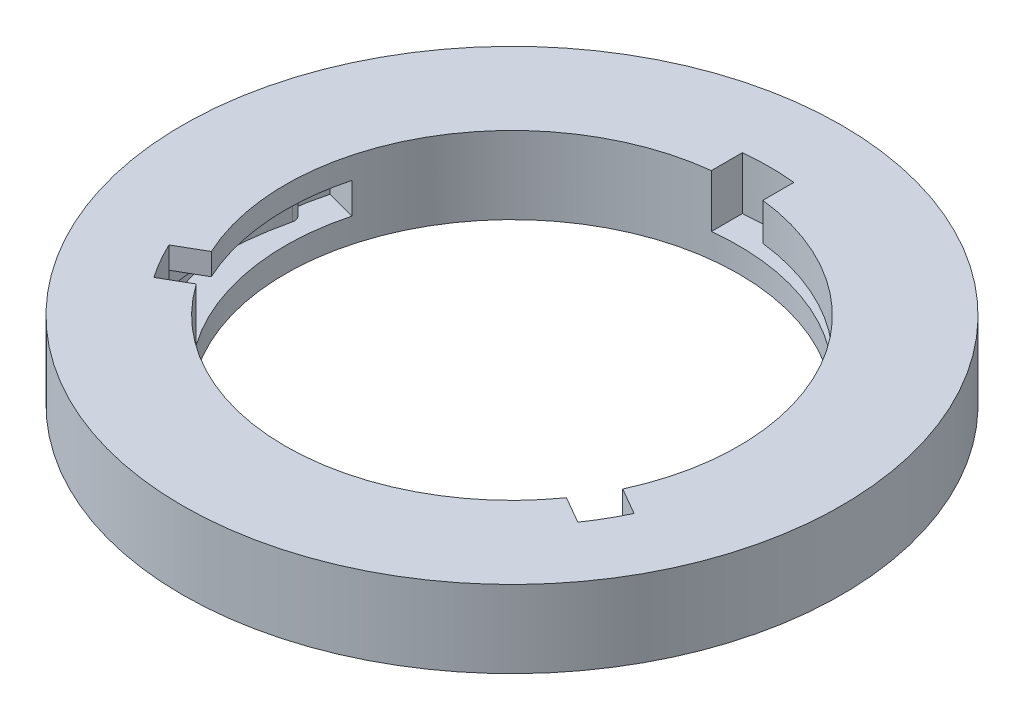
ISO-10303-21;
HEADER;
FILE_DESCRIPTION(('STEP AP214'),'2;1');
FILE_NAME('part.step','',(''),(''),'','','');
FILE_SCHEMA(('AUTOMOTIVE_DESIGN { 1 0 10303 214 1 1 1 1 }'));
ENDSEC;
DATA;
#1=APPLICATION_CONTEXT('core data for automotive mechanical design processes');
#2=APPLICATION_PROTOCOL_DEFINITION('international standard','automotive_design',2000,#1);
#3=PRODUCT_CONTEXT('',#1,'mechanical');
#4=PRODUCT('Part','Part','',(#3));
#5=PRODUCT_RELATED_PRODUCT_CATEGORY('part','',(#4));
#6=PRODUCT_DEFINITION_FORMATION('','',#4);
#7=PRODUCT_DEFINITION_CONTEXT('part definition',#1,'design');
#8=PRODUCT_DEFINITION('design','',#6,#7);
#9=PRODUCT_DEFINITION_SHAPE('','',#8);
#10=(LENGTH_UNIT() NAMED_UNIT(*) SI_UNIT(.MILLI.,.METRE.));
#11=(NAMED_UNIT(*) PLANE_ANGLE_UNIT() SI_UNIT($,.RADIAN.));
#12=(NAMED_UNIT(*) SI_UNIT($,.STERADIAN.) SOLID_ANGLE_UNIT());
#13=UNCERTAINTY_MEASURE_WITH_UNIT(LENGTH_MEASURE(1.E-05),#10,'distance_accuracy_value','');
#14=(GEOMETRIC_REPRESENTATION_CONTEXT(3) GLOBAL_UNCERTAINTY_ASSIGNED_CONTEXT((#13)) GLOBAL_UNIT_ASSIGNED_CONTEXT((#10,
#11,#12)) REPRESENTATION_CONTEXT('',''));
#15=CARTESIAN_POINT('',(0.,0.,0.));
#16=DIRECTION('',(0.,0.,1.));
#17=DIRECTION('',(1.,0.,0.));
#18=AXIS2_PLACEMENT_3D('',#15,#16,#17);
#19=CARTESIAN_POINT('',(0.,40.3076120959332,0.));
#20=DIRECTION('',(0.,1.,0.));
#21=DIRECTION('',(0.,0.,1.));
#22=AXIS2_PLACEMENT_3D('',#19,#20,#21);
#23=CYLINDRICAL_SURFACE('',#22,44.);
#24=CARTESIAN_POINT('',(0.,0.,0.));
#25=DIRECTION('',(0.,1.,0.));
#26=DIRECTION('',(0.,0.,1.));
#27=AXIS2_PLACEMENT_3D('',#24,#25,#26);
#28=CIRCLE('',#27,44.);
#29=CARTESIAN_POINT('',(0.,0.,44.));
#30=VERTEX_POINT('',#29);
#31=EDGE_CURVE('E458',#30,#30,#28,.T.);
#32=ORIENTED_EDGE('',*,*,#31,.F.);
#33=EDGE_LOOP('',(#32));
#34=FACE_BOUND('',#33,.T.);
#35=DIRECTION('',(0.0773926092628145,0.,-0.997000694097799));
#36=VECTOR('',#35,1.);
#37=CARTESIAN_POINT('',(-43.8679537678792,10.75,-3.40626367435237));
#38=LINE('',#37,#36);
#39=CARTESIAN_POINT('',(-43.8681072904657,10.75,-3.40428593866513));
#40=VERTEX_POINT('',#39);
#41=CARTESIAN_POINT('',(-43.8679537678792,10.75,-3.40626367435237));
#42=VERTEX_POINT('',#41);
#43=EDGE_CURVE('E529',#40,#42,#38,.T.);
#44=ORIENTED_EDGE('',*,*,#43,.T.);
#45=CARTESIAN_POINT('',(0.,10.75,0.));
#46=DIRECTION('',(0.,-1.,0.));
#47=DIRECTION('',(0.866025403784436,0.,0.500000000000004));
#48=AXIS2_PLACEMENT_3D('',#45,#46,#47);
#49=CIRCLE('',#48,44.);
#50=CARTESIAN_POINT('',(-42.5007363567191,10.75,-11.3880379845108));
#51=VERTEX_POINT('',#50);
#52=EDGE_CURVE('E258',#42,#51,#49,.T.);
#53=ORIENTED_EDGE('',*,*,#52,.T.);
#54=DIRECTION('',(0.,1.,0.));
#55=VECTOR('',#54,1.);
#56=CARTESIAN_POINT('',(-42.500736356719,7.75,-11.3880379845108));
#57=LINE('',#56,#55);
#58=CARTESIAN_POINT('',(-42.500736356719,4.75,-11.3880379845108));
#59=VERTEX_POINT('',#58);
#60=EDGE_CURVE('E328',#59,#51,#57,.T.);
#61=ORIENTED_EDGE('',*,*,#60,.F.);
#62=CARTESIAN_POINT('',(0.,4.75,0.));
#63=DIRECTION('',(0.,-1.,0.));
#64=DIRECTION('',(0.,0.,1.));
#65=AXIS2_PLACEMENT_3D('',#62,#63,#64);
#66=CIRCLE('',#65,44.);
#67=CARTESIAN_POINT('',(-35.9473319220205,4.75,25.3730039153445));
#68=VERTEX_POINT('',#67);
#69=EDGE_CURVE('E401',#68,#59,#66,.T.);
#70=ORIENTED_EDGE('',*,*,#69,.F.);
#71=DIRECTION('',(0.,1.,0.));
#72=VECTOR('',#71,1.);
#73=CARTESIAN_POINT('',(-35.9473319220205,4.75,25.3730039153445));
#74=LINE('',#73,#72);
#75=CARTESIAN_POINT('',(-35.9473319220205,15.,25.3730039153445));
#76=VERTEX_POINT('',#75);
#77=EDGE_CURVE('E422',#68,#76,#74,.T.);
#78=ORIENTED_EDGE('',*,*,#77,.T.);
#79=CARTESIAN_POINT('',(0.,15.,0.));
#80=DIRECTION('',(0.,1.,0.));
#81=DIRECTION('',(0.,0.,1.));
#82=AXIS2_PLACEMENT_3D('',#79,#80,#81);
#83=CIRCLE('',#82,44.);
#84=CARTESIAN_POINT('',(35.9473319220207,15.,25.3730039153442));
#85=VERTEX_POINT('',#84);
#86=EDGE_CURVE('E482',#76,#85,#83,.T.);
#87=ORIENTED_EDGE('',*,*,#86,.T.);
#88=DIRECTION('',(0.,1.,0.));
#89=VECTOR('',#88,1.);
#90=CARTESIAN_POINT('',(35.9473319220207,4.75,25.3730039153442));
#91=LINE('',#90,#89);
#92=CARTESIAN_POINT('',(35.9473319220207,10.75,25.3730039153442));
#93=VERTEX_POINT('',#92);
#94=EDGE_CURVE('E376',#93,#85,#91,.T.);
#95=ORIENTED_EDGE('',*,*,#94,.F.);
#96=CARTESIAN_POINT('',(0.,10.75,0.));
#97=DIRECTION('',(0.,1.,0.));
#98=DIRECTION('',(0.,0.,-1.));
#99=AXIS2_PLACEMENT_3D('',#96,#97,#98);
#100=CIRCLE('',#99,44.);
#101=CARTESIAN_POINT('',(18.9858555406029,10.75,39.6930382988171));
#102=VERTEX_POINT('',#101);
#103=EDGE_CURVE('E301',#102,#93,#100,.T.);
#104=ORIENTED_EDGE('',*,*,#103,.F.);
#105=DIRECTION('',(-0.902124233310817,0.,0.431476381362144));
#106=VECTOR('',#105,1.);
#107=CARTESIAN_POINT('',(18.9840660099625,10.75,39.6938942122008));
#108=LINE('',#107,#106);
#109=CARTESIAN_POINT('',(18.9840660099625,10.75,39.6938942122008));
#110=VERTEX_POINT('',#109);
#111=EDGE_CURVE('E267',#102,#110,#108,.T.);
#112=ORIENTED_EDGE('',*,*,#111,.T.);
#113=CARTESIAN_POINT('',(0.,10.75,0.));
#114=DIRECTION('',(0.,-1.,0.));
#115=DIRECTION('',(0.,0.,-1.));
#116=AXIS2_PLACEMENT_3D('',#113,#114,#115);
#117=CIRCLE('',#116,44.);
#118=CARTESIAN_POINT('',(11.3880379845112,10.75,42.5007363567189));
#119=VERTEX_POINT('',#118);
#120=EDGE_CURVE('E292',#110,#119,#117,.T.);
#121=ORIENTED_EDGE('',*,*,#120,.T.);
#122=DIRECTION('',(0.,1.,0.));
#123=VECTOR('',#122,1.);
#124=CARTESIAN_POINT('',(11.3880379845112,7.75,42.5007363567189));
#125=LINE('',#124,#123);
#126=CARTESIAN_POINT('',(11.3880379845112,4.75,42.5007363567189));
#127=VERTEX_POINT('',#126);
#128=EDGE_CURVE('E311',#127,#119,#125,.T.);
#129=ORIENTED_EDGE('',*,*,#128,.F.);
#130=CARTESIAN_POINT('',(0.,4.75,0.));
#131=DIRECTION('',(0.,-1.,0.));
#132=DIRECTION('',(0.866025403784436,0.,-0.500000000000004));
#133=AXIS2_PLACEMENT_3D('',#130,#131,#132);
#134=CIRCLE('',#133,44.);
#135=CARTESIAN_POINT('',(39.9473319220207,4.75,18.4448006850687));
#136=VERTEX_POINT('',#135);
#137=EDGE_CURVE('E365',#136,#127,#134,.T.);
#138=ORIENTED_EDGE('',*,*,#137,.F.);
#139=DIRECTION('',(0.,1.,0.));
#140=VECTOR('',#139,1.);
#141=CARTESIAN_POINT('',(39.9473319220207,4.75,18.4448006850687));
#142=LINE('',#141,#140);
#143=CARTESIAN_POINT('',(39.9473319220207,15.,18.4448006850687));
#144=VERTEX_POINT('',#143);
#145=EDGE_CURVE('E386',#136,#144,#142,.T.);
#146=ORIENTED_EDGE('',*,*,#145,.T.);
#147=CARTESIAN_POINT('',(5.,15.,-43.7149859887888));
#148=VERTEX_POINT('',#147);
#149=EDGE_CURVE('E479',#144,#148,#83,.T.);
#150=ORIENTED_EDGE('',*,*,#149,.T.);
#151=DIRECTION('',(0.,1.,0.));
#152=VECTOR('',#151,1.);
#153=CARTESIAN_POINT('',(5.,4.75,-43.7149859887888));
#154=LINE('',#153,#152);
#155=CARTESIAN_POINT('',(5.,7.75,-43.7149859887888));
#156=VERTEX_POINT('',#155);
#157=EDGE_CURVE('E459',#156,#148,#154,.T.);
#158=ORIENTED_EDGE('',*,*,#157,.F.);
#159=CARTESIAN_POINT('',(0.,7.75,0.));
#160=DIRECTION('',(0.,1.,0.));
#161=DIRECTION('',(0.,0.,1.));
#162=AXIS2_PLACEMENT_3D('',#159,#160,#161);
#163=CIRCLE('',#162,44.);
#164=CARTESIAN_POINT('',(31.1126983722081,7.75,-31.112698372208));
#165=VERTEX_POINT('',#164);
#166=EDGE_CURVE('E361',#165,#156,#163,.T.);
#167=ORIENTED_EDGE('',*,*,#166,.F.);
#168=DIRECTION('',(0.,1.,0.));
#169=VECTOR('',#168,1.);
#170=CARTESIAN_POINT('',(31.1126983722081,7.75,-31.112698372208));
#171=LINE('',#170,#169);
#172=CARTESIAN_POINT('',(31.1126983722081,4.75,-31.112698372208));
#173=VERTEX_POINT('',#172);
#174=EDGE_CURVE('E342',#173,#165,#171,.T.);
#175=ORIENTED_EDGE('',*,*,#174,.F.);
#176=CARTESIAN_POINT('',(0.,4.75,0.));
#177=DIRECTION('',(0.,-1.,0.));
#178=DIRECTION('',(0.,0.,1.));
#179=AXIS2_PLACEMENT_3D('',#176,#177,#178);
#180=CIRCLE('',#179,44.);
#181=CARTESIAN_POINT('',(-5.,4.75,-43.7149859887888));
#182=VERTEX_POINT('',#181);
#183=EDGE_CURVE('E443',#182,#173,#180,.T.);
#184=ORIENTED_EDGE('',*,*,#183,.F.);
#185=DIRECTION('',(0.,1.,0.));
#186=VECTOR('',#185,1.);
#187=CARTESIAN_POINT('',(-5.,4.75,-43.7149859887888));
#188=LINE('',#187,#186);
#189=CARTESIAN_POINT('',(-5.,15.,-43.7149859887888));
#190=VERTEX_POINT('',#189);
#191=EDGE_CURVE('E462',#182,#190,#188,.T.);
#192=ORIENTED_EDGE('',*,*,#191,.T.);
#193=CARTESIAN_POINT('',(-39.9473319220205,15.,18.4448006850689));
#194=VERTEX_POINT('',#193);
#195=EDGE_CURVE('E55',#190,#194,#83,.T.);
#196=ORIENTED_EDGE('',*,*,#195,.T.);
#197=DIRECTION('',(0.,1.,0.));
#198=VECTOR('',#197,1.);
#199=CARTESIAN_POINT('',(-39.9473319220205,4.75,18.4448006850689));
#200=LINE('',#199,#198);
#201=CARTESIAN_POINT('',(-39.9473319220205,10.75,18.4448006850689));
#202=VERTEX_POINT('',#201);
#203=EDGE_CURVE('E412',#202,#194,#200,.T.);
#204=ORIENTED_EDGE('',*,*,#203,.F.);
#205=CARTESIAN_POINT('',(0.,10.75,0.));
#206=DIRECTION('',(0.,1.,0.));
#207=DIRECTION('',(0.866025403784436,0.,0.500000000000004));
#208=AXIS2_PLACEMENT_3D('',#205,#206,#207);
#209=CIRCLE('',#208,44.);
#210=EDGE_CURVE('E250',#40,#202,#209,.T.);
#211=ORIENTED_EDGE('',*,*,#210,.F.);
#212=EDGE_LOOP('',(#44,#53,#61,#70,#78,#87,#95,#104,#112,#121,#129,#138,#146,#150,#158,#167,
#175,#184,#192,#196,#204,#211));
#213=FACE_BOUND('',#212,.T.);
#214=ADVANCED_FACE('F47',(#34,#213),#23,.F.);
#215=CARTESIAN_POINT('',(14.100073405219,10.75,12.0776398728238));
#216=DIRECTION('',(0.,-1.,0.));
#217=DIRECTION('',(0.,0.,-1.));
#218=AXIS2_PLACEMENT_3D('',#215,#216,#217);
#219=CYLINDRICAL_SURFACE('',#218,60.);
#220=DIRECTION('',(0.,-1.,0.));
#221=VECTOR('',#220,1.);
#222=CARTESIAN_POINT('',(-44.2957503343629,13.3042482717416,-1.70378856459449));
#223=LINE('',#222,#221);
#224=CARTESIAN_POINT('',(-44.2957503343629,10.75,-1.70378856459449));
#225=VERTEX_POINT('',#224);
#226=CARTESIAN_POINT('',(-44.2957503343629,7.74999999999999,-1.70378856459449));
#227=VERTEX_POINT('',#226);
#228=EDGE_CURVE('E224',#225,#227,#223,.T.);
#229=ORIENTED_EDGE('',*,*,#228,.F.);
#230=CARTESIAN_POINT('',(14.100073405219,10.75,12.0776398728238));
#231=DIRECTION('',(0.,-1.,0.));
#232=DIRECTION('',(-0.866025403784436,0.,-0.500000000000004));
#233=AXIS2_PLACEMENT_3D('',#230,#231,#232);
#234=CIRCLE('',#233,60.);
#235=CARTESIAN_POINT('',(-45.1624837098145,10.75,21.4557699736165));
#236=VERTEX_POINT('',#235);
#237=EDGE_CURVE('E262',#236,#225,#234,.T.);
#238=ORIENTED_EDGE('',*,*,#237,.F.);
#239=DIRECTION('',(0.,1.,0.));
#240=VECTOR('',#239,1.);
#241=CARTESIAN_POINT('',(-45.1624837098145,4.75,21.4557699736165));
#242=LINE('',#241,#240);
#243=CARTESIAN_POINT('',(-45.1624837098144,7.74999999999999,21.4557699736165));
#244=VERTEX_POINT('',#243);
#245=EDGE_CURVE('E248',#244,#236,#242,.T.);
#246=ORIENTED_EDGE('',*,*,#245,.F.);
#247=CARTESIAN_POINT('',(14.100073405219,7.74999999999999,12.0776398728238));
#248=DIRECTION('',(0.,-1.,0.));
#249=DIRECTION('',(-0.866025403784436,0.,-0.500000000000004));
#250=AXIS2_PLACEMENT_3D('',#247,#248,#249);
#251=CIRCLE('',#250,60.);
#252=EDGE_CURVE('E240',#244,#227,#251,.T.);
#253=ORIENTED_EDGE('',*,*,#252,.T.);
#254=EDGE_LOOP('',(#229,#238,#246,#253));
#255=FACE_BOUND('',#254,.T.);
#256=ADVANCED_FACE('F246',(#255),#219,.F.);
#257=CARTESIAN_POINT('',(-42.500736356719,7.74999999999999,-11.3880379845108));
#258=DIRECTION('',(0.,1.,0.));
#259=DIRECTION('',(0.866025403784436,0.,-0.500000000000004));
#260=AXIS2_PLACEMENT_3D('',#257,#258,#259);
#261=PLANE('',#260);
#262=DIRECTION('',(0.996998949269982,0.,0.0774150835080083));
#263=VECTOR('',#262,1.);
#264=CARTESIAN_POINT('',(-43.8679537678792,7.75,-3.40626367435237));
#265=LINE('',#264,#263);
#266=CARTESIAN_POINT('',(-49.8499474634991,7.74999999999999,-3.87075417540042));
#267=VERTEX_POINT('',#266);
#268=CARTESIAN_POINT('',(-45.6395233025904,7.74999999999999,-3.54382269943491));
#269=VERTEX_POINT('',#268);
#270=EDGE_CURVE('E242',#267,#269,#265,.T.);
#271=ORIENTED_EDGE('',*,*,#270,.T.);
#272=CARTESIAN_POINT('',(-45.7556459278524,7.74999999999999,-2.04832427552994));
#273=DIRECTION('',(0.,1.,0.));
#274=DIRECTION('',(0.866025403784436,0.,0.500000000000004));
#275=AXIS2_PLACEMENT_3D('',#272,#273,#274);
#276=CIRCLE('',#275,1.5);
#277=EDGE_CURVE('E227',#227,#269,#276,.T.);
#278=ORIENTED_EDGE('',*,*,#277,.F.);
#279=ORIENTED_EDGE('',*,*,#252,.F.);
#280=CARTESIAN_POINT('',(0.,7.74999999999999,0.));
#281=DIRECTION('',(0.,1.,0.));
#282=DIRECTION('',(0.866025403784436,0.,-0.500000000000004));
#283=AXIS2_PLACEMENT_3D('',#280,#281,#282);
#284=CIRCLE('',#283,50.);
#285=EDGE_CURVE('E339',#267,#244,#284,.T.);
#286=ORIENTED_EDGE('',*,*,#285,.F.);
#287=EDGE_LOOP('',(#271,#278,#279,#286));
#288=FACE_BOUND('',#287,.T.);
#289=ADVANCED_FACE('F238',(#288),#261,.F.);
#290=CARTESIAN_POINT('',(-45.1624837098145,4.75,21.4557699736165));
#291=DIRECTION('',(-0.500000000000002,0.,-0.866025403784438));
#292=DIRECTION('',(-0.866025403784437,0.,0.500000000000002));
#293=AXIS2_PLACEMENT_3D('',#290,#291,#292);
#294=PLANE('',#293);
#295=DIRECTION('',(-0.866025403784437,0.,0.500000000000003));
#296=VECTOR('',#295,1.);
#297=CARTESIAN_POINT('',(-45.1624837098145,10.75,21.4557699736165));
#298=LINE('',#297,#296);
#299=EDGE_CURVE('E255',#202,#236,#298,.T.);
#300=ORIENTED_EDGE('',*,*,#299,.F.);
#301=ORIENTED_EDGE('',*,*,#203,.T.);
#302=DIRECTION('',(-0.866025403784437,0.,0.500000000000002));
#303=VECTOR('',#302,1.);
#304=CARTESIAN_POINT('',(-45.1624837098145,15.,21.4557699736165));
#305=LINE('',#304,#303);
#306=CARTESIAN_POINT('',(-45.1624837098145,15.,21.4557699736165));
#307=VERTEX_POINT('',#306);
#308=EDGE_CURVE('E390',#194,#307,#305,.T.);
#309=ORIENTED_EDGE('',*,*,#308,.T.);
#310=EDGE_CURVE('E432',#236,#307,#242,.T.);
#311=ORIENTED_EDGE('',*,*,#310,.F.);
#312=EDGE_LOOP('',(#300,#301,#309,#311));
#313=FACE_BOUND('',#312,.T.);
#314=ADVANCED_FACE('F526',(#313),#294,.F.);
#315=CARTESIAN_POINT('',(3.40950624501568,10.75,-18.249841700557));
#316=DIRECTION('',(0.,-1.,0.));
#317=DIRECTION('',(0.,0.,-1.));
#318=AXIS2_PLACEMENT_3D('',#315,#316,#317);
#319=CYLINDRICAL_SURFACE('',#318,60.);
#320=DIRECTION('',(0.,-1.,0.));
#321=VECTOR('',#320,1.);
#322=CARTESIAN_POINT('',(20.6723509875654,13.4318568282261,39.2131393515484));
#323=LINE('',#322,#321);
#324=CARTESIAN_POINT('',(20.6723509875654,10.75,39.2131393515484));
#325=VERTEX_POINT('',#324);
#326=CARTESIAN_POINT('',(20.6723509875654,7.74999999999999,39.2131393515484));
#327=VERTEX_POINT('',#326);
#328=EDGE_CURVE('E274',#325,#327,#323,.T.);
#329=ORIENTED_EDGE('',*,*,#328,.F.);
#330=CARTESIAN_POINT('',(3.40950624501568,10.75,-18.249841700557));
#331=DIRECTION('',(0.,-1.,0.));
#332=DIRECTION('',(0.,0.,1.));
#333=AXIS2_PLACEMENT_3D('',#330,#331,#332);
#334=CIRCLE('',#333,60.);
#335=CARTESIAN_POINT('',(41.1624837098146,10.75,28.3839732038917));
#336=VERTEX_POINT('',#335);
#337=EDGE_CURVE('E307',#336,#325,#334,.T.);
#338=ORIENTED_EDGE('',*,*,#337,.F.);
#339=DIRECTION('',(0.,1.,0.));
#340=VECTOR('',#339,1.);
#341=CARTESIAN_POINT('',(41.1624837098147,4.75,28.3839732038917));
#342=LINE('',#341,#340);
#343=CARTESIAN_POINT('',(41.1624837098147,7.74999999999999,28.3839732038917));
#344=VERTEX_POINT('',#343);
#345=EDGE_CURVE('E394',#344,#336,#342,.T.);
#346=ORIENTED_EDGE('',*,*,#345,.F.);
#347=CARTESIAN_POINT('',(3.40950624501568,7.74999999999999,-18.249841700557));
#348=DIRECTION('',(0.,-1.,0.));
#349=DIRECTION('',(0.,0.,1.));
#350=AXIS2_PLACEMENT_3D('',#347,#348,#349);
#351=CIRCLE('',#350,60.);
#352=EDGE_CURVE('E300',#344,#327,#351,.T.);
#353=ORIENTED_EDGE('',*,*,#352,.T.);
#354=EDGE_LOOP('',(#329,#338,#346,#353));
#355=FACE_BOUND('',#354,.T.);
#356=ADVANCED_FACE('F589',(#355),#319,.F.);
#357=CARTESIAN_POINT('',(11.3880379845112,7.74999999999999,42.5007363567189));
#358=DIRECTION('',(0.,1.,0.));
#359=DIRECTION('',(-0.866025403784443,0.,-0.499999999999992));
#360=AXIS2_PLACEMENT_3D('',#357,#358,#359);
#361=PLANE('',#360);
#362=DIRECTION('',(-0.431456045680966,0.,-0.902133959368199));
#363=VECTOR('',#362,1.);
#364=CARTESIAN_POINT('',(18.9840660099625,7.75,39.6938942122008));
#365=LINE('',#364,#363);
#366=CARTESIAN_POINT('',(21.5728022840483,7.74999999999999,45.10669796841));
#367=VERTEX_POINT('',#366);
#368=CARTESIAN_POINT('',(19.7507211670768,7.74999999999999,41.2968979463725));
#369=VERTEX_POINT('',#368);
#370=EDGE_CURVE('E282',#367,#369,#365,.T.);
#371=ORIENTED_EDGE('',*,*,#370,.T.);
#372=CARTESIAN_POINT('',(21.1039221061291,7.74999999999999,40.6497138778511));
#373=DIRECTION('',(0.,1.,0.));
#374=DIRECTION('',(0.,0.,-1.));
#375=AXIS2_PLACEMENT_3D('',#372,#373,#374);
#376=CIRCLE('',#375,1.5);
#377=EDGE_CURVE('E271',#327,#369,#376,.T.);
#378=ORIENTED_EDGE('',*,*,#377,.F.);
#379=ORIENTED_EDGE('',*,*,#352,.F.);
#380=CARTESIAN_POINT('',(0.,7.74999999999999,0.));
#381=DIRECTION('',(0.,1.,0.));
#382=DIRECTION('',(-0.866025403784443,0.,-0.499999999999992));
#383=AXIS2_PLACEMENT_3D('',#380,#381,#382);
#384=CIRCLE('',#383,50.);
#385=EDGE_CURVE('E325',#367,#344,#384,.T.);
#386=ORIENTED_EDGE('',*,*,#385,.F.);
#387=EDGE_LOOP('',(#371,#378,#379,#386));
#388=FACE_BOUND('',#387,.T.);
#389=ADVANCED_FACE('F594',(#388),#361,.F.);
#390=CARTESIAN_POINT('',(41.1624837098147,4.75,28.3839732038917));
#391=DIRECTION('',(-0.499999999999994,0.,0.866025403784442));
#392=DIRECTION('',(0.866025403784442,0.,0.499999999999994));
#393=AXIS2_PLACEMENT_3D('',#390,#391,#392);
#394=PLANE('',#393);
#395=DIRECTION('',(0.866025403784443,0.,0.499999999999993));
#396=VECTOR('',#395,1.);
#397=CARTESIAN_POINT('',(41.1624837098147,10.75,28.3839732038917));
#398=LINE('',#397,#396);
#399=EDGE_CURVE('E304',#93,#336,#398,.T.);
#400=ORIENTED_EDGE('',*,*,#399,.F.);
#401=ORIENTED_EDGE('',*,*,#94,.T.);
#402=DIRECTION('',(0.866025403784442,0.,0.499999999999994));
#403=VECTOR('',#402,1.);
#404=CARTESIAN_POINT('',(41.1624837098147,15.,28.3839732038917));
#405=LINE('',#404,#403);
#406=CARTESIAN_POINT('',(41.1624837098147,15.,28.3839732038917));
#407=VERTEX_POINT('',#406);
#408=EDGE_CURVE('E364',#85,#407,#405,.T.);
#409=ORIENTED_EDGE('',*,*,#408,.T.);
#410=EDGE_CURVE('E398',#336,#407,#342,.T.);
#411=ORIENTED_EDGE('',*,*,#410,.F.);
#412=EDGE_LOOP('',(#400,#401,#409,#411));
#413=FACE_BOUND('',#412,.T.);
#414=ADVANCED_FACE('F581',(#413),#394,.F.);
#415=CARTESIAN_POINT('',(44.,15.,0.));
#416=DIRECTION('',(0.,-1.,0.));
#417=DIRECTION('',(0.,0.,-1.));
#418=AXIS2_PLACEMENT_3D('',#415,#416,#417);
#419=PLANE('',#418);
#420=ORIENTED_EDGE('',*,*,#149,.F.);
#421=DIRECTION('',(-0.866025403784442,0.,-0.499999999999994));
#422=VECTOR('',#421,1.);
#423=CARTESIAN_POINT('',(45.1624837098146,15.,21.4557699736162));
#424=LINE('',#423,#422);
#425=CARTESIAN_POINT('',(45.1624837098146,15.,21.4557699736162));
#426=VERTEX_POINT('',#425);
#427=EDGE_CURVE('E369',#426,#144,#424,.T.);
#428=ORIENTED_EDGE('',*,*,#427,.F.);
#429=CARTESIAN_POINT('',(0.,15.,0.));
#430=DIRECTION('',(0.,1.,0.));
#431=DIRECTION('',(0.866025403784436,0.,-0.500000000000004));
#432=AXIS2_PLACEMENT_3D('',#429,#430,#431);
#433=CIRCLE('',#432,50.);
#434=EDGE_CURVE('E380',#407,#426,#433,.T.);
#435=ORIENTED_EDGE('',*,*,#434,.F.);
#436=ORIENTED_EDGE('',*,*,#408,.F.);
#437=ORIENTED_EDGE('',*,*,#86,.F.);
#438=DIRECTION('',(0.866025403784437,0.,-0.500000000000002));
#439=VECTOR('',#438,1.);
#440=CARTESIAN_POINT('',(-41.1624837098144,15.,28.383973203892));
#441=LINE('',#440,#439);
#442=CARTESIAN_POINT('',(-41.1624837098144,15.,28.383973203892));
#443=VERTEX_POINT('',#442);
#444=EDGE_CURVE('E405',#443,#76,#441,.T.);
#445=ORIENTED_EDGE('',*,*,#444,.F.);
#446=CARTESIAN_POINT('',(0.,15.,0.));
#447=DIRECTION('',(0.,1.,0.));
#448=DIRECTION('',(0.,0.,1.));
#449=AXIS2_PLACEMENT_3D('',#446,#447,#448);
#450=CIRCLE('',#449,50.);
#451=EDGE_CURVE('E416',#307,#443,#450,.T.);
#452=ORIENTED_EDGE('',*,*,#451,.F.);
#453=ORIENTED_EDGE('',*,*,#308,.F.);
#454=ORIENTED_EDGE('',*,*,#195,.F.);
#455=DIRECTION('',(0.,0.,1.));
#456=VECTOR('',#455,1.);
#457=CARTESIAN_POINT('',(-5.00000000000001,15.,-49.749371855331));
#458=LINE('',#457,#456);
#459=CARTESIAN_POINT('',(-5.,15.,-49.749371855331));
#460=VERTEX_POINT('',#459);
#461=EDGE_CURVE('E449',#460,#190,#458,.T.);
#462=ORIENTED_EDGE('',*,*,#461,.F.);
#463=CARTESIAN_POINT('',(0.,15.,0.));
#464=DIRECTION('',(0.,1.,0.));
#465=DIRECTION('',(0.,0.,1.));
#466=AXIS2_PLACEMENT_3D('',#463,#464,#465);
#467=CIRCLE('',#466,50.);
#468=CARTESIAN_POINT('',(4.99999999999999,15.,-49.749371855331));
#469=VERTEX_POINT('',#468);
#470=EDGE_CURVE('E426',#469,#460,#467,.T.);
#471=ORIENTED_EDGE('',*,*,#470,.F.);
#472=DIRECTION('',(0.,0.,-1.));
#473=VECTOR('',#472,1.);
#474=CARTESIAN_POINT('',(4.99999999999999,15.,-49.749371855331));
#475=LINE('',#474,#473);
#476=EDGE_CURVE('E439',#148,#469,#475,.T.);
#477=ORIENTED_EDGE('',*,*,#476,.F.);
#478=EDGE_LOOP('',(#420,#428,#435,#436,#437,#445,#452,#453,#454,#462,#471,#477));
#479=FACE_BOUND('',#478,.T.);
#480=CARTESIAN_POINT('',(0.,15.,0.));
#481=DIRECTION('',(0.,1.,0.));
#482=DIRECTION('',(0.,0.,1.));
#483=AXIS2_PLACEMENT_3D('',#480,#481,#482);
#484=CIRCLE('',#483,64.);
#485=CARTESIAN_POINT('',(0.,15.,64.));
#486=VERTEX_POINT('',#485);
#487=EDGE_CURVE('E476',#486,#486,#484,.T.);
#488=ORIENTED_EDGE('',*,*,#487,.T.);
#489=EDGE_LOOP('',(#488));
#490=FACE_BOUND('',#489,.T.);
#491=ADVANCED_FACE('F498',(#479,#490),#419,.F.);
#492=CARTESIAN_POINT('',(0.,40.3076120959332,0.));
#493=DIRECTION('',(0.,1.,0.));
#494=DIRECTION('',(0.,0.,1.));
#495=AXIS2_PLACEMENT_3D('',#492,#493,#494);
#496=CYLINDRICAL_SURFACE('',#495,64.);
#497=ORIENTED_EDGE('',*,*,#487,.F.);
#498=EDGE_LOOP('',(#497));
#499=FACE_BOUND('',#498,.T.);
#500=CARTESIAN_POINT('',(0.,0.,0.));
#501=DIRECTION('',(0.,1.,0.));
#502=DIRECTION('',(0.,0.,1.));
#503=AXIS2_PLACEMENT_3D('',#500,#501,#502);
#504=CIRCLE('',#503,64.);
#505=CARTESIAN_POINT('',(0.,0.,64.));
#506=VERTEX_POINT('',#505);
#507=EDGE_CURVE('E472',#506,#506,#504,.T.);
#508=ORIENTED_EDGE('',*,*,#507,.T.);
#509=EDGE_LOOP('',(#508));
#510=FACE_BOUND('',#509,.T.);
#511=ADVANCED_FACE('F639',(#499,#510),#496,.T.);
#512=CARTESIAN_POINT('',(44.,0.,0.));
#513=DIRECTION('',(0.,1.,0.));
#514=DIRECTION('',(0.,0.,1.));
#515=AXIS2_PLACEMENT_3D('',#512,#513,#514);
#516=PLANE('',#515);
#517=ORIENTED_EDGE('',*,*,#507,.F.);
#518=EDGE_LOOP('',(#517));
#519=FACE_BOUND('',#518,.T.);
#520=ORIENTED_EDGE('',*,*,#31,.T.);
#521=EDGE_LOOP('',(#520));
#522=FACE_BOUND('',#521,.T.);
#523=ADVANCED_FACE('F637',(#519,#522),#516,.F.);
#524=CARTESIAN_POINT('',(0.,4.75,0.));
#525=DIRECTION('',(0.,1.,0.));
#526=DIRECTION('',(0.,0.,1.));
#527=AXIS2_PLACEMENT_3D('',#524,#525,#526);
#528=CYLINDRICAL_SURFACE('',#527,50.);
#529=CARTESIAN_POINT('',(0.,7.74999999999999,0.));
#530=DIRECTION('',(0.,1.,0.));
#531=DIRECTION('',(0.,0.,1.));
#532=AXIS2_PLACEMENT_3D('',#529,#530,#531);
#533=CIRCLE('',#532,50.);
#534=CARTESIAN_POINT('',(35.3553390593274,7.74999999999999,-35.3553390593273));
#535=VERTEX_POINT('',#534);
#536=CARTESIAN_POINT('',(4.99999999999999,7.74999999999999,-49.749371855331));
#537=VERTEX_POINT('',#536);
#538=EDGE_CURVE('E357',#535,#537,#533,.T.);
#539=ORIENTED_EDGE('',*,*,#538,.T.);
#540=DIRECTION('',(0.,1.,0.));
#541=VECTOR('',#540,1.);
#542=CARTESIAN_POINT('',(4.99999999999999,4.75,-49.749371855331));
#543=LINE('',#542,#541);
#544=EDGE_CURVE('E455',#537,#469,#543,.T.);
#545=ORIENTED_EDGE('',*,*,#544,.T.);
#546=ORIENTED_EDGE('',*,*,#470,.T.);
#547=DIRECTION('',(0.,1.,0.));
#548=VECTOR('',#547,1.);
#549=CARTESIAN_POINT('',(-5.00000000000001,4.75,-49.749371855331));
#550=LINE('',#549,#548);
#551=CARTESIAN_POINT('',(-5.00000000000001,4.75,-49.749371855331));
#552=VERTEX_POINT('',#551);
#553=EDGE_CURVE('E446',#552,#460,#550,.T.);
#554=ORIENTED_EDGE('',*,*,#553,.F.);
#555=CARTESIAN_POINT('',(0.,4.75,0.));
#556=DIRECTION('',(0.,1.,0.));
#557=DIRECTION('',(0.,0.,1.));
#558=AXIS2_PLACEMENT_3D('',#555,#556,#557);
#559=CIRCLE('',#558,50.);
#560=CARTESIAN_POINT('',(35.3553390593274,4.75,-35.3553390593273));
#561=VERTEX_POINT('',#560);
#562=EDGE_CURVE('E435',#561,#552,#559,.T.);
#563=ORIENTED_EDGE('',*,*,#562,.F.);
#564=DIRECTION('',(0.,-1.,0.));
#565=VECTOR('',#564,1.);
#566=CARTESIAN_POINT('',(35.3553390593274,7.74999999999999,-35.3553390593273));
#567=LINE('',#566,#565);
#568=EDGE_CURVE('E349',#535,#561,#567,.T.);
#569=ORIENTED_EDGE('',*,*,#568,.F.);
#570=EDGE_LOOP('',(#539,#545,#546,#554,#563,#569));
#571=FACE_BOUND('',#570,.T.);
#572=ADVANCED_FACE('F509',(#571),#528,.F.);
#573=CARTESIAN_POINT('',(4.99999999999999,4.75,-49.749371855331));
#574=DIRECTION('',(1.,0.,0.));
#575=DIRECTION('',(0.,0.,-1.));
#576=AXIS2_PLACEMENT_3D('',#573,#574,#575);
#577=PLANE('',#576);
#578=ORIENTED_EDGE('',*,*,#544,.F.);
#579=DIRECTION('',(0.,0.,1.));
#580=VECTOR('',#579,1.);
#581=CARTESIAN_POINT('',(4.99999999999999,7.74999999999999,-49.749371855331));
#582=LINE('',#581,#580);
#583=EDGE_CURVE('E11',#537,#156,#582,.T.);
#584=ORIENTED_EDGE('',*,*,#583,.T.);
#585=ORIENTED_EDGE('',*,*,#157,.T.);
#586=ORIENTED_EDGE('',*,*,#476,.T.);
#587=EDGE_LOOP('',(#578,#584,#585,#586));
#588=FACE_BOUND('',#587,.T.);
#589=ADVANCED_FACE('F503',(#588),#577,.F.);
#590=CARTESIAN_POINT('',(-5.00000000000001,4.75,-49.749371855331));
#591=DIRECTION('',(-1.,0.,0.));
#592=DIRECTION('',(0.,0.,1.));
#593=AXIS2_PLACEMENT_3D('',#590,#591,#592);
#594=PLANE('',#593);
#595=ORIENTED_EDGE('',*,*,#461,.T.);
#596=ORIENTED_EDGE('',*,*,#191,.F.);
#597=DIRECTION('',(0.,0.,1.));
#598=VECTOR('',#597,1.);
#599=CARTESIAN_POINT('',(-5.00000000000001,4.75,-49.749371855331));
#600=LINE('',#599,#598);
#601=EDGE_CURVE('E438',#552,#182,#600,.T.);
#602=ORIENTED_EDGE('',*,*,#601,.F.);
#603=ORIENTED_EDGE('',*,*,#553,.T.);
#604=EDGE_LOOP('',(#595,#596,#602,#603));
#605=FACE_BOUND('',#604,.T.);
#606=ADVANCED_FACE('F670',(#605),#594,.F.);
#607=CARTESIAN_POINT('',(0.,4.75,0.));
#608=DIRECTION('',(0.,1.,0.));
#609=DIRECTION('',(0.,0.,1.));
#610=AXIS2_PLACEMENT_3D('',#607,#608,#609);
#611=PLANE('',#610);
#612=ORIENTED_EDGE('',*,*,#183,.T.);
#613=DIRECTION('',(-0.707106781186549,0.,0.707106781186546));
#614=VECTOR('',#613,1.);
#615=CARTESIAN_POINT('',(35.3553390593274,4.75,-35.3553390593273));
#616=LINE('',#615,#614);
#617=EDGE_CURVE('E353',#561,#173,#616,.T.);
#618=ORIENTED_EDGE('',*,*,#617,.F.);
#619=ORIENTED_EDGE('',*,*,#562,.T.);
#620=ORIENTED_EDGE('',*,*,#601,.T.);
#621=EDGE_LOOP('',(#612,#618,#619,#620));
#622=FACE_BOUND('',#621,.T.);
#623=ADVANCED_FACE('F516',(#622),#611,.T.);
#624=CARTESIAN_POINT('',(-41.1624837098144,4.75,28.383973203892));
#625=DIRECTION('',(0.500000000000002,0.,0.866025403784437));
#626=DIRECTION('',(0.866025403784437,0.,-0.500000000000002));
#627=AXIS2_PLACEMENT_3D('',#624,#625,#626);
#628=PLANE('',#627);
#629=ORIENTED_EDGE('',*,*,#444,.T.);
#630=ORIENTED_EDGE('',*,*,#77,.F.);
#631=DIRECTION('',(0.866025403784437,0.,-0.500000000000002));
#632=VECTOR('',#631,1.);
#633=CARTESIAN_POINT('',(-41.1624837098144,4.75,28.383973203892));
#634=LINE('',#633,#632);
#635=CARTESIAN_POINT('',(-41.1624837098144,4.75,28.383973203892));
#636=VERTEX_POINT('',#635);
#637=EDGE_CURVE('E408',#636,#68,#634,.T.);
#638=ORIENTED_EDGE('',*,*,#637,.F.);
#639=DIRECTION('',(0.,1.,0.));
#640=VECTOR('',#639,1.);
#641=CARTESIAN_POINT('',(-41.1624837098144,4.75,28.383973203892));
#642=LINE('',#641,#640);
#643=EDGE_CURVE('E427',#636,#443,#642,.T.);
#644=ORIENTED_EDGE('',*,*,#643,.T.);
#645=EDGE_LOOP('',(#629,#630,#638,#644));
#646=FACE_BOUND('',#645,.T.);
#647=ADVANCED_FACE('F574',(#646),#628,.F.);
#648=CARTESIAN_POINT('',(0.,4.75,0.));
#649=DIRECTION('',(0.,1.,0.));
#650=DIRECTION('',(0.,0.,1.));
#651=AXIS2_PLACEMENT_3D('',#648,#649,#650);
#652=CYLINDRICAL_SURFACE('',#651,50.);
#653=DIRECTION('',(0.,-1.,0.));
#654=VECTOR('',#653,1.);
#655=CARTESIAN_POINT('',(-48.2962913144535,7.74999999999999,-12.9409522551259));
#656=LINE('',#655,#654);
#657=CARTESIAN_POINT('',(-48.2962913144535,10.75,-12.9409522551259));
#658=VERTEX_POINT('',#657);
#659=CARTESIAN_POINT('',(-48.2962913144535,4.75,-12.9409522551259));
#660=VERTEX_POINT('',#659);
#661=EDGE_CURVE('E331',#658,#660,#656,.T.);
#662=ORIENTED_EDGE('',*,*,#661,.F.);
#663=CARTESIAN_POINT('',(0.,10.75,0.));
#664=DIRECTION('',(0.,-1.,0.));
#665=DIRECTION('',(0.866025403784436,0.,0.500000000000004));
#666=AXIS2_PLACEMENT_3D('',#663,#664,#665);
#667=CIRCLE('',#666,50.);
#668=CARTESIAN_POINT('',(-49.8499474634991,10.75,-3.87075417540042));
#669=VERTEX_POINT('',#668);
#670=EDGE_CURVE('E251',#669,#658,#667,.T.);
#671=ORIENTED_EDGE('',*,*,#670,.F.);
#672=DIRECTION('',(0.,-1.,0.));
#673=VECTOR('',#672,1.);
#674=CARTESIAN_POINT('',(-49.8499474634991,7.74999999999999,-3.87075417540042));
#675=LINE('',#674,#673);
#676=EDGE_CURVE('E550',#669,#267,#675,.T.);
#677=ORIENTED_EDGE('',*,*,#676,.T.);
#678=ORIENTED_EDGE('',*,*,#285,.T.);
#679=ORIENTED_EDGE('',*,*,#245,.T.);
#680=ORIENTED_EDGE('',*,*,#310,.T.);
#681=ORIENTED_EDGE('',*,*,#451,.T.);
#682=ORIENTED_EDGE('',*,*,#643,.F.);
#683=CARTESIAN_POINT('',(0.,4.75,0.));
#684=DIRECTION('',(0.,1.,0.));
#685=DIRECTION('',(0.,0.,1.));
#686=AXIS2_PLACEMENT_3D('',#683,#684,#685);
#687=CIRCLE('',#686,50.);
#688=EDGE_CURVE('E404',#660,#636,#687,.T.);
#689=ORIENTED_EDGE('',*,*,#688,.F.);
#690=EDGE_LOOP('',(#662,#671,#677,#678,#679,#680,#681,#682,#689));
#691=FACE_BOUND('',#690,.T.);
#692=ADVANCED_FACE('F562',(#691),#652,.F.);
#693=CARTESIAN_POINT('',(0.,4.75,0.));
#694=DIRECTION('',(0.,1.,0.));
#695=DIRECTION('',(0.,0.,1.));
#696=AXIS2_PLACEMENT_3D('',#693,#694,#695);
#697=PLANE('',#696);
#698=ORIENTED_EDGE('',*,*,#69,.T.);
#699=DIRECTION('',(0.965925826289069,0.,0.258819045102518));
#700=VECTOR('',#699,1.);
#701=CARTESIAN_POINT('',(-48.2962913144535,4.75,-12.9409522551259));
#702=LINE('',#701,#700);
#703=EDGE_CURVE('E335',#660,#59,#702,.T.);
#704=ORIENTED_EDGE('',*,*,#703,.F.);
#705=ORIENTED_EDGE('',*,*,#688,.T.);
#706=ORIENTED_EDGE('',*,*,#637,.T.);
#707=EDGE_LOOP('',(#698,#704,#705,#706));
#708=FACE_BOUND('',#707,.T.);
#709=ADVANCED_FACE('F570',(#708),#697,.T.);
#710=CARTESIAN_POINT('',(45.1624837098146,4.75,21.4557699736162));
#711=DIRECTION('',(0.499999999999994,0.,-0.866025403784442));
#712=DIRECTION('',(-0.866025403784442,0.,-0.499999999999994));
#713=AXIS2_PLACEMENT_3D('',#710,#711,#712);
#714=PLANE('',#713);
#715=ORIENTED_EDGE('',*,*,#427,.T.);
#716=ORIENTED_EDGE('',*,*,#145,.F.);
#717=DIRECTION('',(-0.866025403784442,0.,-0.499999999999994));
#718=VECTOR('',#717,1.);
#719=CARTESIAN_POINT('',(45.1624837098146,4.75,21.4557699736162));
#720=LINE('',#719,#718);
#721=CARTESIAN_POINT('',(45.1624837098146,4.75,21.4557699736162));
#722=VERTEX_POINT('',#721);
#723=EDGE_CURVE('E372',#722,#136,#720,.T.);
#724=ORIENTED_EDGE('',*,*,#723,.F.);
#725=DIRECTION('',(0.,1.,0.));
#726=VECTOR('',#725,1.);
#727=CARTESIAN_POINT('',(45.1624837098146,4.75,21.4557699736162));
#728=LINE('',#727,#726);
#729=EDGE_CURVE('E391',#722,#426,#728,.T.);
#730=ORIENTED_EDGE('',*,*,#729,.T.);
#731=EDGE_LOOP('',(#715,#716,#724,#730));
#732=FACE_BOUND('',#731,.T.);
#733=ADVANCED_FACE('F615',(#732),#714,.F.);
#734=CARTESIAN_POINT('',(0.,4.75,0.));
#735=DIRECTION('',(0.,1.,0.));
#736=DIRECTION('',(0.,0.,1.));
#737=AXIS2_PLACEMENT_3D('',#734,#735,#736);
#738=CYLINDRICAL_SURFACE('',#737,50.);
#739=DIRECTION('',(0.,-1.,0.));
#740=VECTOR('',#739,1.);
#741=CARTESIAN_POINT('',(12.9409522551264,7.74999999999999,48.2962913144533));
#742=LINE('',#741,#740);
#743=CARTESIAN_POINT('',(12.9409522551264,10.75,48.2962913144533));
#744=VERTEX_POINT('',#743);
#745=CARTESIAN_POINT('',(12.9409522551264,4.75,48.2962913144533));
#746=VERTEX_POINT('',#745);
#747=EDGE_CURVE('E317',#744,#746,#742,.T.);
#748=ORIENTED_EDGE('',*,*,#747,.F.);
#749=CARTESIAN_POINT('',(0.,10.75,0.));
#750=DIRECTION('',(0.,-1.,0.));
#751=DIRECTION('',(0.,0.,-1.));
#752=AXIS2_PLACEMENT_3D('',#749,#750,#751);
#753=CIRCLE('',#752,50.);
#754=CARTESIAN_POINT('',(21.5728022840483,10.75,45.10669796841));
#755=VERTEX_POINT('',#754);
#756=EDGE_CURVE('E296',#755,#744,#753,.T.);
#757=ORIENTED_EDGE('',*,*,#756,.F.);
#758=DIRECTION('',(0.,-1.,0.));
#759=VECTOR('',#758,1.);
#760=CARTESIAN_POINT('',(21.5728022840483,7.74999999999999,45.10669796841));
#761=LINE('',#760,#759);
#762=EDGE_CURVE('E289',#755,#367,#761,.T.);
#763=ORIENTED_EDGE('',*,*,#762,.T.);
#764=ORIENTED_EDGE('',*,*,#385,.T.);
#765=ORIENTED_EDGE('',*,*,#345,.T.);
#766=ORIENTED_EDGE('',*,*,#410,.T.);
#767=ORIENTED_EDGE('',*,*,#434,.T.);
#768=ORIENTED_EDGE('',*,*,#729,.F.);
#769=CARTESIAN_POINT('',(0.,4.75,0.));
#770=DIRECTION('',(0.,1.,0.));
#771=DIRECTION('',(0.866025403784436,0.,-0.500000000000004));
#772=AXIS2_PLACEMENT_3D('',#769,#770,#771);
#773=CIRCLE('',#772,50.);
#774=EDGE_CURVE('E368',#746,#722,#773,.T.);
#775=ORIENTED_EDGE('',*,*,#774,.F.);
#776=EDGE_LOOP('',(#748,#757,#763,#764,#765,#766,#767,#768,#775));
#777=FACE_BOUND('',#776,.T.);
#778=ADVANCED_FACE('F604',(#777),#738,.F.);
#779=CARTESIAN_POINT('',(0.,4.75,0.));
#780=DIRECTION('',(0.,1.,0.));
#781=DIRECTION('',(0.866025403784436,0.,-0.500000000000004));
#782=AXIS2_PLACEMENT_3D('',#779,#780,#781);
#783=PLANE('',#782);
#784=ORIENTED_EDGE('',*,*,#137,.T.);
#785=DIRECTION('',(-0.258819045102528,0.,-0.965925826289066));
#786=VECTOR('',#785,1.);
#787=CARTESIAN_POINT('',(12.9409522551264,4.75,48.2962913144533));
#788=LINE('',#787,#786);
#789=EDGE_CURVE('E321',#746,#127,#788,.T.);
#790=ORIENTED_EDGE('',*,*,#789,.F.);
#791=ORIENTED_EDGE('',*,*,#774,.T.);
#792=ORIENTED_EDGE('',*,*,#723,.T.);
#793=EDGE_LOOP('',(#784,#790,#791,#792));
#794=FACE_BOUND('',#793,.T.);
#795=ADVANCED_FACE('F611',(#794),#783,.T.);
#796=CARTESIAN_POINT('',(31.1126983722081,7.74999999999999,-31.112698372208));
#797=DIRECTION('',(0.,1.,0.));
#798=DIRECTION('',(0.,0.,1.));
#799=AXIS2_PLACEMENT_3D('',#796,#797,#798);
#800=PLANE('',#799);
#801=ORIENTED_EDGE('',*,*,#538,.F.);
#802=DIRECTION('',(0.707106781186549,0.,-0.707106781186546));
#803=VECTOR('',#802,1.);
#804=CARTESIAN_POINT('',(31.1126983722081,7.75,-31.112698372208));
#805=LINE('',#804,#803);
#806=EDGE_CURVE('E345',#165,#535,#805,.T.);
#807=ORIENTED_EDGE('',*,*,#806,.F.);
#808=ORIENTED_EDGE('',*,*,#166,.T.);
#809=ORIENTED_EDGE('',*,*,#583,.F.);
#810=EDGE_LOOP('',(#801,#807,#808,#809));
#811=FACE_BOUND('',#810,.T.);
#812=ADVANCED_FACE('F505',(#811),#800,.F.);
#813=CARTESIAN_POINT('',(0.,0.,0.));
#814=DIRECTION('',(-0.707106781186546,0.,-0.707106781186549));
#815=DIRECTION('',(-0.707106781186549,0.,0.707106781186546));
#816=AXIS2_PLACEMENT_3D('',#813,#814,#815);
#817=PLANE('',#816);
#818=ORIENTED_EDGE('',*,*,#174,.T.);
#819=ORIENTED_EDGE('',*,*,#806,.T.);
#820=ORIENTED_EDGE('',*,*,#568,.T.);
#821=ORIENTED_EDGE('',*,*,#617,.T.);
#822=EDGE_LOOP('',(#818,#819,#820,#821));
#823=FACE_BOUND('',#822,.T.);
#824=ADVANCED_FACE('F513',(#823),#817,.T.);
#825=CARTESIAN_POINT('',(0.,0.,0.));
#826=DIRECTION('',(-0.258819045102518,0.,0.965925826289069));
#827=DIRECTION('',(0.965925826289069,0.,0.258819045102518));
#828=AXIS2_PLACEMENT_3D('',#825,#826,#827);
#829=PLANE('',#828);
#830=ORIENTED_EDGE('',*,*,#60,.T.);
#831=DIRECTION('',(-0.965925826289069,0.,-0.258819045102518));
#832=VECTOR('',#831,1.);
#833=CARTESIAN_POINT('',(-48.2962913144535,10.75,-12.9409522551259));
#834=LINE('',#833,#832);
#835=EDGE_CURVE('E535',#51,#658,#834,.T.);
#836=ORIENTED_EDGE('',*,*,#835,.T.);
#837=ORIENTED_EDGE('',*,*,#661,.T.);
#838=ORIENTED_EDGE('',*,*,#703,.T.);
#839=EDGE_LOOP('',(#830,#836,#837,#838));
#840=FACE_BOUND('',#839,.T.);
#841=ADVANCED_FACE('F564',(#840),#829,.T.);
#842=CARTESIAN_POINT('',(0.,0.,0.));
#843=DIRECTION('',(0.965925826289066,0.,-0.258819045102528));
#844=DIRECTION('',(-0.258819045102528,0.,-0.965925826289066));
#845=AXIS2_PLACEMENT_3D('',#842,#843,#844);
#846=PLANE('',#845);
#847=ORIENTED_EDGE('',*,*,#128,.T.);
#848=DIRECTION('',(0.258819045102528,0.,0.965925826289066));
#849=VECTOR('',#848,1.);
#850=CARTESIAN_POINT('',(12.9409522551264,10.75,48.2962913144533));
#851=LINE('',#850,#849);
#852=EDGE_CURVE('E270',#119,#744,#851,.T.);
#853=ORIENTED_EDGE('',*,*,#852,.T.);
#854=ORIENTED_EDGE('',*,*,#747,.T.);
#855=ORIENTED_EDGE('',*,*,#789,.T.);
#856=EDGE_LOOP('',(#847,#853,#854,#855));
#857=FACE_BOUND('',#856,.T.);
#858=ADVANCED_FACE('F608',(#857),#846,.T.);
#859=CARTESIAN_POINT('',(0.,10.75,0.));
#860=DIRECTION('',(0.,-1.,0.));
#861=DIRECTION('',(0.,0.,-1.));
#862=AXIS2_PLACEMENT_3D('',#859,#860,#861);
#863=PLANE('',#862);
#864=ORIENTED_EDGE('',*,*,#103,.T.);
#865=ORIENTED_EDGE('',*,*,#399,.T.);
#866=ORIENTED_EDGE('',*,*,#337,.T.);
#867=CARTESIAN_POINT('',(21.1039221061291,10.75,40.6497138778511));
#868=DIRECTION('',(0.,-1.,0.));
#869=DIRECTION('',(0.,0.,-1.));
#870=AXIS2_PLACEMENT_3D('',#867,#868,#869);
#871=CIRCLE('',#870,1.5);
#872=CARTESIAN_POINT('',(19.7507211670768,10.75,41.2968979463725));
#873=VERTEX_POINT('',#872);
#874=EDGE_CURVE('E264',#873,#325,#871,.T.);
#875=ORIENTED_EDGE('',*,*,#874,.F.);
#876=DIRECTION('',(0.431456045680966,0.,0.902133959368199));
#877=VECTOR('',#876,1.);
#878=CARTESIAN_POINT('',(21.5728022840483,10.75,45.10669796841));
#879=LINE('',#878,#877);
#880=EDGE_CURVE('E286',#873,#755,#879,.T.);
#881=ORIENTED_EDGE('',*,*,#880,.T.);
#882=ORIENTED_EDGE('',*,*,#756,.T.);
#883=ORIENTED_EDGE('',*,*,#852,.F.);
#884=ORIENTED_EDGE('',*,*,#120,.F.);
#885=ORIENTED_EDGE('',*,*,#111,.F.);
#886=EDGE_LOOP('',(#864,#865,#866,#875,#881,#882,#883,#884,#885));
#887=FACE_BOUND('',#886,.T.);
#888=ADVANCED_FACE('F585',(#887),#863,.T.);
#889=CARTESIAN_POINT('',(0.,0.,0.));
#890=DIRECTION('',(-0.902133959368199,0.,0.431456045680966));
#891=DIRECTION('',(0.431456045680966,0.,0.902133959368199));
#892=AXIS2_PLACEMENT_3D('',#889,#890,#891);
#893=PLANE('',#892);
#894=DIRECTION('',(0.,-1.,0.));
#895=VECTOR('',#894,1.);
#896=CARTESIAN_POINT('',(19.7507211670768,13.4318568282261,41.2968979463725));
#897=LINE('',#896,#895);
#898=EDGE_CURVE('E70',#873,#369,#897,.T.);
#899=ORIENTED_EDGE('',*,*,#898,.T.);
#900=ORIENTED_EDGE('',*,*,#370,.F.);
#901=ORIENTED_EDGE('',*,*,#762,.F.);
#902=ORIENTED_EDGE('',*,*,#880,.F.);
#903=EDGE_LOOP('',(#899,#900,#901,#902));
#904=FACE_BOUND('',#903,.T.);
#905=ADVANCED_FACE('F599',(#904),#893,.T.);
#906=CARTESIAN_POINT('',(21.1039221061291,13.4318568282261,40.6497138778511));
#907=DIRECTION('',(0.,-1.,0.));
#908=DIRECTION('',(0.,0.,-1.));
#909=AXIS2_PLACEMENT_3D('',#906,#907,#908);
#910=CYLINDRICAL_SURFACE('',#909,1.5);
#911=ORIENTED_EDGE('',*,*,#874,.T.);
#912=ORIENTED_EDGE('',*,*,#328,.T.);
#913=ORIENTED_EDGE('',*,*,#377,.T.);
#914=ORIENTED_EDGE('',*,*,#898,.F.);
#915=EDGE_LOOP('',(#911,#912,#913,#914));
#916=FACE_BOUND('',#915,.T.);
#917=ADVANCED_FACE('F592',(#916),#910,.T.);
#918=CARTESIAN_POINT('',(0.,10.75,0.));
#919=DIRECTION('',(0.,-1.,0.));
#920=DIRECTION('',(0.866025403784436,0.,0.500000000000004));
#921=AXIS2_PLACEMENT_3D('',#918,#919,#920);
#922=PLANE('',#921);
#923=ORIENTED_EDGE('',*,*,#210,.T.);
#924=ORIENTED_EDGE('',*,*,#299,.T.);
#925=ORIENTED_EDGE('',*,*,#237,.T.);
#926=CARTESIAN_POINT('',(-45.7556459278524,10.75,-2.04832427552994));
#927=DIRECTION('',(0.,-1.,0.));
#928=DIRECTION('',(0.,0.,-1.));
#929=AXIS2_PLACEMENT_3D('',#926,#927,#928);
#930=CIRCLE('',#929,1.5);
#931=CARTESIAN_POINT('',(-45.6395233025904,10.75,-3.54382269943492));
#932=VERTEX_POINT('',#931);
#933=EDGE_CURVE('E228',#932,#225,#930,.T.);
#934=ORIENTED_EDGE('',*,*,#933,.F.);
#935=DIRECTION('',(-0.996998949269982,0.,-0.0774150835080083));
#936=VECTOR('',#935,1.);
#937=CARTESIAN_POINT('',(-49.8499474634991,10.75,-3.87075417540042));
#938=LINE('',#937,#936);
#939=EDGE_CURVE('E547',#932,#669,#938,.T.);
#940=ORIENTED_EDGE('',*,*,#939,.T.);
#941=ORIENTED_EDGE('',*,*,#670,.T.);
#942=ORIENTED_EDGE('',*,*,#835,.F.);
#943=ORIENTED_EDGE('',*,*,#52,.F.);
#944=ORIENTED_EDGE('',*,*,#43,.F.);
#945=EDGE_LOOP('',(#923,#924,#925,#934,#940,#941,#942,#943,#944));
#946=FACE_BOUND('',#945,.T.);
#947=ADVANCED_FACE('F532',(#946),#922,.T.);
#948=CARTESIAN_POINT('',(0.,0.,0.));
#949=DIRECTION('',(0.0774150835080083,0.,-0.996998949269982));
#950=DIRECTION('',(-0.996998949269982,0.,-0.0774150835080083));
#951=AXIS2_PLACEMENT_3D('',#948,#949,#950);
#952=PLANE('',#951);
#953=DIRECTION('',(0.,-1.,0.));
#954=VECTOR('',#953,1.);
#955=CARTESIAN_POINT('',(-45.6395233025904,13.3042482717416,-3.54382269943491));
#956=LINE('',#955,#954);
#957=EDGE_CURVE('E62',#932,#269,#956,.T.);
#958=ORIENTED_EDGE('',*,*,#957,.T.);
#959=ORIENTED_EDGE('',*,*,#270,.F.);
#960=ORIENTED_EDGE('',*,*,#676,.F.);
#961=ORIENTED_EDGE('',*,*,#939,.F.);
#962=EDGE_LOOP('',(#958,#959,#960,#961));
#963=FACE_BOUND('',#962,.T.);
#964=ADVANCED_FACE('F560',(#963),#952,.T.);
#965=CARTESIAN_POINT('',(-45.7556459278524,13.3042482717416,-2.04832427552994));
#966=DIRECTION('',(0.,-1.,0.));
#967=DIRECTION('',(0.,0.,-1.));
#968=AXIS2_PLACEMENT_3D('',#965,#966,#967);
#969=CYLINDRICAL_SURFACE('',#968,1.5);
#970=ORIENTED_EDGE('',*,*,#933,.T.);
#971=ORIENTED_EDGE('',*,*,#228,.T.);
#972=ORIENTED_EDGE('',*,*,#277,.T.);
#973=ORIENTED_EDGE('',*,*,#957,.F.);
#974=EDGE_LOOP('',(#970,#971,#972,#973));
#975=FACE_BOUND('',#974,.T.);
#976=ADVANCED_FACE('F226',(#975),#969,.T.);
#977=CLOSED_SHELL('',(#214,#256,#289,#314,#356,#389,#414,#491,#511,#523,#572,#589,#606,#623,
#647,#692,#709,#733,#778,#795,#812,#824,#841,#858,#888,#905,#917,#947,#964,#976));
#978=MANIFOLD_SOLID_BREP('B2',#977);
#979=ADVANCED_BREP_SHAPE_REPRESENTATION('',(#18,#978),#14);
#980=SHAPE_DEFINITION_REPRESENTATION(#9,#979);
ENDSEC;
END-ISO-10303-21;
